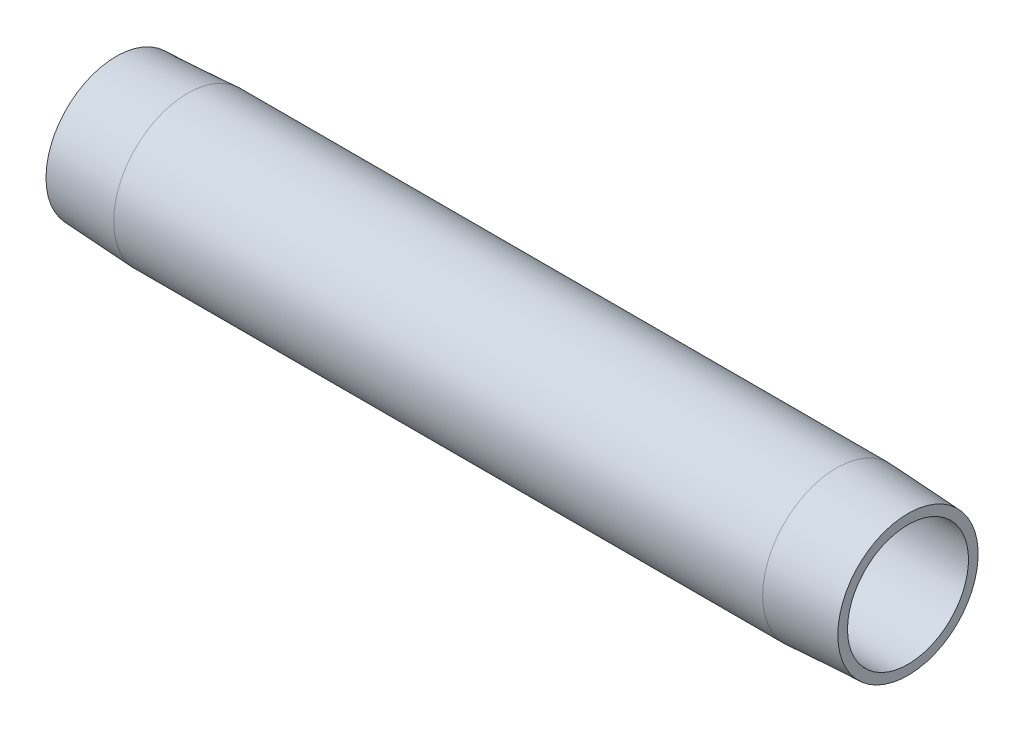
ISO-10303-21;
HEADER;
FILE_DESCRIPTION(('STEP AP214'),'2;1');
FILE_NAME('part.step','',(''),(''),'','','');
FILE_SCHEMA(('AUTOMOTIVE_DESIGN { 1 0 10303 214 1 1 1 1 }'));
ENDSEC;
DATA;
#1=APPLICATION_CONTEXT('core data for automotive mechanical design processes');
#2=APPLICATION_PROTOCOL_DEFINITION('international standard','automotive_design',2000,#1);
#3=PRODUCT_CONTEXT('',#1,'mechanical');
#4=PRODUCT('Part','Part','',(#3));
#5=PRODUCT_RELATED_PRODUCT_CATEGORY('part','',(#4));
#6=PRODUCT_DEFINITION_FORMATION('','',#4);
#7=PRODUCT_DEFINITION_CONTEXT('part definition',#1,'design');
#8=PRODUCT_DEFINITION('design','',#6,#7);
#9=PRODUCT_DEFINITION_SHAPE('','',#8);
#10=(LENGTH_UNIT() NAMED_UNIT(*) SI_UNIT(.MILLI.,.METRE.));
#11=(NAMED_UNIT(*) PLANE_ANGLE_UNIT() SI_UNIT($,.RADIAN.));
#12=(NAMED_UNIT(*) SI_UNIT($,.STERADIAN.) SOLID_ANGLE_UNIT());
#13=UNCERTAINTY_MEASURE_WITH_UNIT(LENGTH_MEASURE(1.E-05),#10,'distance_accuracy_value','');
#14=(GEOMETRIC_REPRESENTATION_CONTEXT(3) GLOBAL_UNCERTAINTY_ASSIGNED_CONTEXT((#13)) GLOBAL_UNIT_ASSIGNED_CONTEXT((#10,
#11,#12)) REPRESENTATION_CONTEXT('',''));
#15=CARTESIAN_POINT('',(0.,0.,0.));
#16=DIRECTION('',(0.,0.,1.));
#17=DIRECTION('',(1.,0.,0.));
#18=AXIS2_PLACEMENT_3D('',#15,#16,#17);
#19=CARTESIAN_POINT('',(114.3,8.73125,0.));
#20=DIRECTION('',(-1.,0.,0.));
#21=DIRECTION('',(0.,0.,1.));
#22=AXIS2_PLACEMENT_3D('',#19,#20,#21);
#23=PLANE('',#22);
#24=CARTESIAN_POINT('',(114.3,0.,0.));
#25=DIRECTION('',(-1.,0.,0.));
#26=DIRECTION('',(0.,0.,1.));
#27=AXIS2_PLACEMENT_3D('',#24,#25,#26);
#28=CIRCLE('',#27,10.1275500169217);
#29=CARTESIAN_POINT('',(114.3,0.,10.1275500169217));
#30=VERTEX_POINT('',#29);
#31=EDGE_CURVE('E10',#30,#30,#28,.T.);
#32=ORIENTED_EDGE('',*,*,#31,.F.);
#33=EDGE_LOOP('',(#32));
#34=FACE_BOUND('',#33,.T.);
#35=CARTESIAN_POINT('',(114.3,0.,0.));
#36=DIRECTION('',(-1.,0.,0.));
#37=DIRECTION('',(0.,0.,1.));
#38=AXIS2_PLACEMENT_3D('',#35,#36,#37);
#39=CIRCLE('',#38,8.73125);
#40=CARTESIAN_POINT('',(114.3,0.,8.73125));
#41=VERTEX_POINT('',#40);
#42=EDGE_CURVE('E52',#41,#41,#39,.T.);
#43=ORIENTED_EDGE('',*,*,#42,.T.);
#44=EDGE_LOOP('',(#43));
#45=FACE_BOUND('',#44,.T.);
#46=ADVANCED_FACE('F30',(#34,#45),#23,.F.);
#47=CARTESIAN_POINT('',(114.3,0.,0.));
#48=DIRECTION('',(-1.,0.,0.));
#49=DIRECTION('',(0.,0.,1.));
#50=AXIS2_PLACEMENT_3D('',#47,#48,#49);
#51=CONICAL_SURFACE('',#50,10.1275500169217,0.0523598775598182);
#52=CARTESIAN_POINT('',(103.9876,0.,0.));
#53=DIRECTION('',(-1.,0.,0.));
#54=DIRECTION('',(0.,0.,1.));
#55=AXIS2_PLACEMENT_3D('',#52,#53,#54);
#56=CIRCLE('',#55,10.668);
#57=CARTESIAN_POINT('',(103.9876,0.,10.668));
#58=VERTEX_POINT('',#57);
#59=EDGE_CURVE('E36',#58,#58,#56,.T.);
#60=ORIENTED_EDGE('',*,*,#59,.F.);
#61=EDGE_LOOP('',(#60));
#62=FACE_BOUND('',#61,.T.);
#63=ORIENTED_EDGE('',*,*,#31,.T.);
#64=EDGE_LOOP('',(#63));
#65=FACE_BOUND('',#64,.T.);
#66=ADVANCED_FACE('F77',(#62,#65),#51,.T.);
#67=CARTESIAN_POINT('',(0.,0.,0.));
#68=DIRECTION('',(-1.,0.,0.));
#69=DIRECTION('',(0.,0.,1.));
#70=AXIS2_PLACEMENT_3D('',#67,#68,#69);
#71=CYLINDRICAL_SURFACE('',#70,10.668);
#72=CARTESIAN_POINT('',(10.3124,0.,0.));
#73=DIRECTION('',(-1.,0.,0.));
#74=DIRECTION('',(0.,0.,1.));
#75=AXIS2_PLACEMENT_3D('',#72,#73,#74);
#76=CIRCLE('',#75,10.668);
#77=CARTESIAN_POINT('',(10.3124,0.,10.668));
#78=VERTEX_POINT('',#77);
#79=EDGE_CURVE('E40',#78,#78,#76,.T.);
#80=ORIENTED_EDGE('',*,*,#79,.F.);
#81=EDGE_LOOP('',(#80));
#82=FACE_BOUND('',#81,.T.);
#83=ORIENTED_EDGE('',*,*,#59,.T.);
#84=EDGE_LOOP('',(#83));
#85=FACE_BOUND('',#84,.T.);
#86=ADVANCED_FACE('F72',(#82,#85),#71,.T.);
#87=CARTESIAN_POINT('',(10.3124,0.,0.));
#88=DIRECTION('',(1.,0.,0.));
#89=DIRECTION('',(0.,0.,-1.));
#90=AXIS2_PLACEMENT_3D('',#87,#88,#89);
#91=CONICAL_SURFACE('',#90,10.668,0.0523598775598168);
#92=CARTESIAN_POINT('',(0.,0.,0.));
#93=DIRECTION('',(-1.,0.,0.));
#94=DIRECTION('',(0.,0.,1.));
#95=AXIS2_PLACEMENT_3D('',#92,#93,#94);
#96=CIRCLE('',#95,10.1275500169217);
#97=CARTESIAN_POINT('',(0.,0.,10.1275500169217));
#98=VERTEX_POINT('',#97);
#99=EDGE_CURVE('E44',#98,#98,#96,.T.);
#100=ORIENTED_EDGE('',*,*,#99,.F.);
#101=EDGE_LOOP('',(#100));
#102=FACE_BOUND('',#101,.T.);
#103=ORIENTED_EDGE('',*,*,#79,.T.);
#104=EDGE_LOOP('',(#103));
#105=FACE_BOUND('',#104,.T.);
#106=ADVANCED_FACE('F66',(#102,#105),#91,.T.);
#107=CARTESIAN_POINT('',(0.,10.1275500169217,0.));
#108=DIRECTION('',(1.,0.,0.));
#109=DIRECTION('',(0.,0.,-1.));
#110=AXIS2_PLACEMENT_3D('',#107,#108,#109);
#111=PLANE('',#110);
#112=CARTESIAN_POINT('',(0.,0.,0.));
#113=DIRECTION('',(-1.,0.,0.));
#114=DIRECTION('',(0.,0.,1.));
#115=AXIS2_PLACEMENT_3D('',#112,#113,#114);
#116=CIRCLE('',#115,8.73125);
#117=CARTESIAN_POINT('',(0.,0.,8.73125));
#118=VERTEX_POINT('',#117);
#119=EDGE_CURVE('E49',#118,#118,#116,.T.);
#120=ORIENTED_EDGE('',*,*,#119,.F.);
#121=EDGE_LOOP('',(#120));
#122=FACE_BOUND('',#121,.T.);
#123=ORIENTED_EDGE('',*,*,#99,.T.);
#124=EDGE_LOOP('',(#123));
#125=FACE_BOUND('',#124,.T.);
#126=ADVANCED_FACE('F60',(#122,#125),#111,.F.);
#127=CARTESIAN_POINT('',(0.,0.,0.));
#128=DIRECTION('',(-1.,0.,0.));
#129=DIRECTION('',(0.,0.,1.));
#130=AXIS2_PLACEMENT_3D('',#127,#128,#129);
#131=CYLINDRICAL_SURFACE('',#130,8.73125);
#132=ORIENTED_EDGE('',*,*,#42,.F.);
#133=EDGE_LOOP('',(#132));
#134=FACE_BOUND('',#133,.T.);
#135=ORIENTED_EDGE('',*,*,#119,.T.);
#136=EDGE_LOOP('',(#135));
#137=FACE_BOUND('',#136,.T.);
#138=ADVANCED_FACE('F57',(#134,#137),#131,.F.);
#139=CLOSED_SHELL('',(#46,#66,#86,#106,#126,#138));
#140=MANIFOLD_SOLID_BREP('B2',#139);
#141=ADVANCED_BREP_SHAPE_REPRESENTATION('',(#18,#140),#14);
#142=SHAPE_DEFINITION_REPRESENTATION(#9,#141);
ENDSEC;
END-ISO-10303-21;
